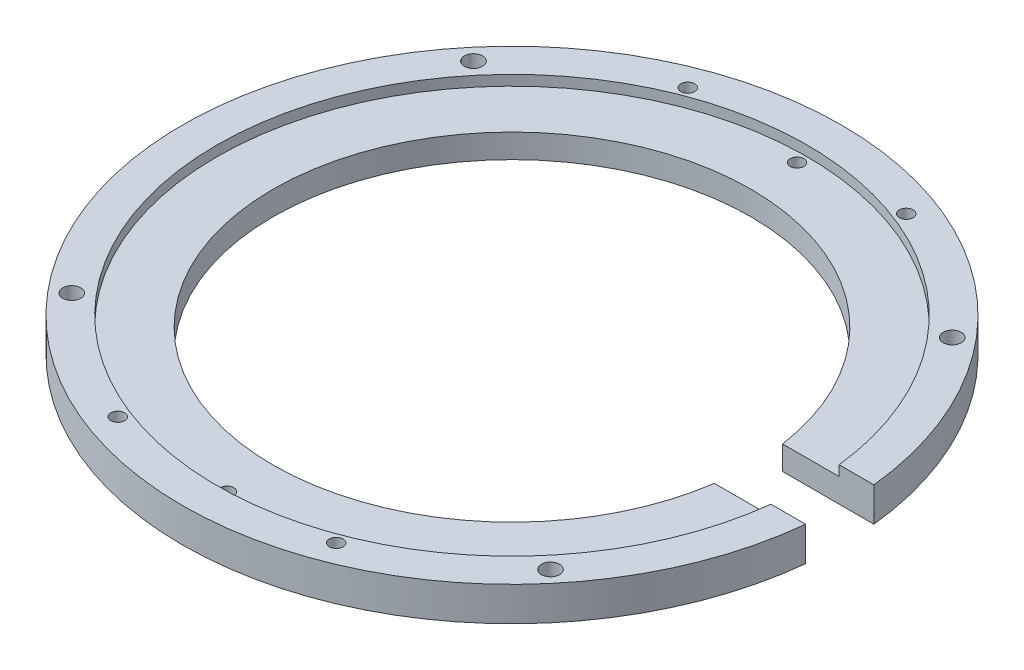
ISO-10303-21;
HEADER;
FILE_DESCRIPTION(('STEP AP214'),'2;1');
FILE_NAME('part.step','',(''),(''),'','','');
FILE_SCHEMA(('AUTOMOTIVE_DESIGN { 1 0 10303 214 1 1 1 1 }'));
ENDSEC;
DATA;
#1=APPLICATION_CONTEXT('core data for automotive mechanical design processes');
#2=APPLICATION_PROTOCOL_DEFINITION('international standard','automotive_design',2000,#1);
#3=PRODUCT_CONTEXT('',#1,'mechanical');
#4=PRODUCT('Part','Part','',(#3));
#5=PRODUCT_RELATED_PRODUCT_CATEGORY('part','',(#4));
#6=PRODUCT_DEFINITION_FORMATION('','',#4);
#7=PRODUCT_DEFINITION_CONTEXT('part definition',#1,'design');
#8=PRODUCT_DEFINITION('design','',#6,#7);
#9=PRODUCT_DEFINITION_SHAPE('','',#8);
#10=(LENGTH_UNIT() NAMED_UNIT(*) SI_UNIT(.MILLI.,.METRE.));
#11=(NAMED_UNIT(*) PLANE_ANGLE_UNIT() SI_UNIT($,.RADIAN.));
#12=(NAMED_UNIT(*) SI_UNIT($,.STERADIAN.) SOLID_ANGLE_UNIT());
#13=UNCERTAINTY_MEASURE_WITH_UNIT(LENGTH_MEASURE(1.E-05),#10,'distance_accuracy_value','');
#14=(GEOMETRIC_REPRESENTATION_CONTEXT(3) GLOBAL_UNCERTAINTY_ASSIGNED_CONTEXT((#13)) GLOBAL_UNIT_ASSIGNED_CONTEXT((#10,
#11,#12)) REPRESENTATION_CONTEXT('',''));
#15=CARTESIAN_POINT('',(0.,0.,0.));
#16=DIRECTION('',(0.,0.,1.));
#17=DIRECTION('',(1.,0.,0.));
#18=AXIS2_PLACEMENT_3D('',#15,#16,#17);
#19=CARTESIAN_POINT('',(0.,0.,0.));
#20=DIRECTION('',(0.,-1.,0.));
#21=DIRECTION('',(0.,0.,-1.));
#22=AXIS2_PLACEMENT_3D('',#19,#20,#21);
#23=CYLINDRICAL_SURFACE('',#22,122.618499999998);
#24=CARTESIAN_POINT('',(0.,12.7,0.));
#25=DIRECTION('',(0.,-1.,0.));
#26=DIRECTION('',(0.,0.,-1.));
#27=AXIS2_PLACEMENT_3D('',#24,#25,#26);
#28=CIRCLE('',#27,122.618499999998);
#29=CARTESIAN_POINT('',(121.959036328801,12.7,12.6999999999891));
#30=VERTEX_POINT('',#29);
#31=CARTESIAN_POINT('',(121.959036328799,12.7,-12.7000000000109));
#32=VERTEX_POINT('',#31);
#33=EDGE_CURVE('E152',#30,#32,#28,.T.);
#34=ORIENTED_EDGE('',*,*,#33,.T.);
#35=DIRECTION('',(0.,-1.,0.));
#36=VECTOR('',#35,1.);
#37=CARTESIAN_POINT('',(121.959036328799,0.,-12.7000000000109));
#38=LINE('',#37,#36);
#39=CARTESIAN_POINT('',(121.959036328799,0.,-12.7000000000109));
#40=VERTEX_POINT('',#39);
#41=EDGE_CURVE('E75',#32,#40,#38,.T.);
#42=ORIENTED_EDGE('',*,*,#41,.T.);
#43=CARTESIAN_POINT('',(0.,0.,0.));
#44=DIRECTION('',(0.,-1.,0.));
#45=DIRECTION('',(0.,0.,-1.));
#46=AXIS2_PLACEMENT_3D('',#43,#44,#45);
#47=CIRCLE('',#46,122.618499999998);
#48=CARTESIAN_POINT('',(121.959036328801,0.,12.6999999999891));
#49=VERTEX_POINT('',#48);
#50=EDGE_CURVE('E126',#49,#40,#47,.T.);
#51=ORIENTED_EDGE('',*,*,#50,.F.);
#52=DIRECTION('',(0.,-1.,0.));
#53=VECTOR('',#52,1.);
#54=CARTESIAN_POINT('',(121.959036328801,0.,12.6999999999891));
#55=LINE('',#54,#53);
#56=EDGE_CURVE('E108',#49,#30,#55,.F.);
#57=ORIENTED_EDGE('',*,*,#56,.T.);
#58=EDGE_LOOP('',(#34,#42,#51,#57));
#59=FACE_BOUND('',#58,.T.);
#60=ADVANCED_FACE('F46',(#59),#23,.T.);
#61=CARTESIAN_POINT('',(-88.9,0.,0.));
#62=DIRECTION('',(0.,1.,0.));
#63=DIRECTION('',(0.,0.,1.));
#64=AXIS2_PLACEMENT_3D('',#61,#62,#63);
#65=PLANE('',#64);
#66=CARTESIAN_POINT('',(-89.0668383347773,0.,-74.7359511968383));
#67=DIRECTION('',(0.,-1.,0.));
#68=DIRECTION('',(0.,0.,-1.));
#69=AXIS2_PLACEMENT_3D('',#66,#67,#68);
#70=CIRCLE('',#69,3.37350099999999);
#71=CARTESIAN_POINT('',(-89.0668383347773,0.,-78.1094521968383));
#72=VERTEX_POINT('',#71);
#73=EDGE_CURVE('E225',#72,#72,#70,.T.);
#74=ORIENTED_EDGE('',*,*,#73,.F.);
#75=EDGE_LOOP('',(#74));
#76=FACE_BOUND('',#75,.T.);
#77=CARTESIAN_POINT('',(-89.0668383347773,0.,74.7359511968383));
#78=DIRECTION('',(0.,-1.,0.));
#79=DIRECTION('',(0.,0.,-1.));
#80=AXIS2_PLACEMENT_3D('',#77,#78,#79);
#81=CIRCLE('',#80,3.37350099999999);
#82=CARTESIAN_POINT('',(-89.0668383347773,0.,71.3624501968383));
#83=VERTEX_POINT('',#82);
#84=EDGE_CURVE('E217',#83,#83,#81,.T.);
#85=ORIENTED_EDGE('',*,*,#84,.F.);
#86=EDGE_LOOP('',(#85));
#87=FACE_BOUND('',#86,.T.);
#88=CARTESIAN_POINT('',(89.0668383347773,0.,74.7359511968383));
#89=DIRECTION('',(0.,-1.,0.));
#90=DIRECTION('',(0.,0.,-1.));
#91=AXIS2_PLACEMENT_3D('',#88,#89,#90);
#92=CIRCLE('',#91,3.37350099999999);
#93=CARTESIAN_POINT('',(89.0668383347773,0.,71.3624501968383));
#94=VERTEX_POINT('',#93);
#95=EDGE_CURVE('E209',#94,#94,#92,.T.);
#96=ORIENTED_EDGE('',*,*,#95,.F.);
#97=EDGE_LOOP('',(#96));
#98=FACE_BOUND('',#97,.T.);
#99=CARTESIAN_POINT('',(89.0668383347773,0.,-74.7359511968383));
#100=DIRECTION('',(0.,-1.,0.));
#101=DIRECTION('',(0.,0.,-1.));
#102=AXIS2_PLACEMENT_3D('',#99,#100,#101);
#103=CIRCLE('',#102,3.37350099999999);
#104=CARTESIAN_POINT('',(89.0668383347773,0.,-78.1094521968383));
#105=VERTEX_POINT('',#104);
#106=EDGE_CURVE('E201',#105,#105,#103,.T.);
#107=ORIENTED_EDGE('',*,*,#106,.F.);
#108=EDGE_LOOP('',(#107));
#109=FACE_BOUND('',#108,.T.);
#110=CARTESIAN_POINT('',(-40.64,0.,106.045));
#111=DIRECTION('',(0.,-1.,0.));
#112=DIRECTION('',(0.,0.,-1.));
#113=AXIS2_PLACEMENT_3D('',#110,#111,#112);
#114=CIRCLE('',#113,2.5527);
#115=CARTESIAN_POINT('',(-40.64,0.,103.4923));
#116=VERTEX_POINT('',#115);
#117=EDGE_CURVE('E194',#116,#116,#114,.T.);
#118=ORIENTED_EDGE('',*,*,#117,.F.);
#119=EDGE_LOOP('',(#118));
#120=FACE_BOUND('',#119,.T.);
#121=CARTESIAN_POINT('',(40.64,0.,106.045));
#122=DIRECTION('',(0.,-1.,0.));
#123=DIRECTION('',(0.,0.,-1.));
#124=AXIS2_PLACEMENT_3D('',#121,#122,#123);
#125=CIRCLE('',#124,2.5527);
#126=CARTESIAN_POINT('',(40.64,0.,103.4923));
#127=VERTEX_POINT('',#126);
#128=EDGE_CURVE('E186',#127,#127,#125,.T.);
#129=ORIENTED_EDGE('',*,*,#128,.F.);
#130=EDGE_LOOP('',(#129));
#131=FACE_BOUND('',#130,.T.);
#132=CARTESIAN_POINT('',(-40.64,0.,-106.045));
#133=DIRECTION('',(0.,-1.,0.));
#134=DIRECTION('',(0.,0.,-1.));
#135=AXIS2_PLACEMENT_3D('',#132,#133,#134);
#136=CIRCLE('',#135,2.5527);
#137=CARTESIAN_POINT('',(-40.64,0.,-108.5977));
#138=VERTEX_POINT('',#137);
#139=EDGE_CURVE('E178',#138,#138,#136,.T.);
#140=ORIENTED_EDGE('',*,*,#139,.F.);
#141=EDGE_LOOP('',(#140));
#142=FACE_BOUND('',#141,.T.);
#143=CARTESIAN_POINT('',(40.64,0.,-106.045));
#144=DIRECTION('',(0.,-1.,0.));
#145=DIRECTION('',(0.,0.,-1.));
#146=AXIS2_PLACEMENT_3D('',#143,#144,#145);
#147=CIRCLE('',#146,2.5527);
#148=CARTESIAN_POINT('',(40.64,0.,-108.5977));
#149=VERTEX_POINT('',#148);
#150=EDGE_CURVE('E172',#149,#149,#147,.T.);
#151=ORIENTED_EDGE('',*,*,#150,.F.);
#152=EDGE_LOOP('',(#151));
#153=FACE_BOUND('',#152,.T.);
#154=CARTESIAN_POINT('',(0.,0.,-106.045));
#155=DIRECTION('',(0.,-1.,0.));
#156=DIRECTION('',(0.,0.,-1.));
#157=AXIS2_PLACEMENT_3D('',#154,#155,#156);
#158=CIRCLE('',#157,2.5527);
#159=CARTESIAN_POINT('',(0.,0.,-108.5977));
#160=VERTEX_POINT('',#159);
#161=EDGE_CURVE('E166',#160,#160,#158,.T.);
#162=ORIENTED_EDGE('',*,*,#161,.F.);
#163=EDGE_LOOP('',(#162));
#164=FACE_BOUND('',#163,.T.);
#165=CARTESIAN_POINT('',(0.,0.,106.045));
#166=DIRECTION('',(0.,-1.,0.));
#167=DIRECTION('',(0.,0.,-1.));
#168=AXIS2_PLACEMENT_3D('',#165,#166,#167);
#169=CIRCLE('',#168,2.5527);
#170=CARTESIAN_POINT('',(0.,0.,103.4923));
#171=VERTEX_POINT('',#170);
#172=EDGE_CURVE('E159',#171,#171,#169,.T.);
#173=ORIENTED_EDGE('',*,*,#172,.F.);
#174=EDGE_LOOP('',(#173));
#175=FACE_BOUND('',#174,.T.);
#176=ORIENTED_EDGE('',*,*,#50,.T.);
#177=DIRECTION('',(1.,0.,0.));
#178=VECTOR('',#177,1.);
#179=CARTESIAN_POINT('',(61.1298426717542,0.,-12.7000000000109));
#180=LINE('',#179,#178);
#181=CARTESIAN_POINT('',(87.9881810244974,0.,-12.7000000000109));
#182=VERTEX_POINT('',#181);
#183=EDGE_CURVE('E130',#182,#40,#180,.T.);
#184=ORIENTED_EDGE('',*,*,#183,.F.);
#185=CARTESIAN_POINT('',(0.,0.,0.));
#186=DIRECTION('',(0.,-1.,0.));
#187=DIRECTION('',(0.,0.,-1.));
#188=AXIS2_PLACEMENT_3D('',#185,#186,#187);
#189=CIRCLE('',#188,88.9);
#190=CARTESIAN_POINT('',(87.9881810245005,0.,12.6999999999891));
#191=VERTEX_POINT('',#190);
#192=EDGE_CURVE('E128',#191,#182,#189,.T.);
#193=ORIENTED_EDGE('',*,*,#192,.F.);
#194=DIRECTION('',(-1.,0.,0.));
#195=VECTOR('',#194,1.);
#196=CARTESIAN_POINT('',(61.1298426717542,0.,12.6999999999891));
#197=LINE('',#196,#195);
#198=EDGE_CURVE('E111',#49,#191,#197,.T.);
#199=ORIENTED_EDGE('',*,*,#198,.F.);
#200=EDGE_LOOP('',(#176,#184,#193,#199));
#201=FACE_BOUND('',#200,.T.);
#202=ADVANCED_FACE('F124',(#76,#87,#98,#109,#120,#131,#142,#153,#164,#175,#201),#65,.F.);
#203=CARTESIAN_POINT('',(0.,0.,0.));
#204=DIRECTION('',(0.,-1.,0.));
#205=DIRECTION('',(0.,0.,-1.));
#206=AXIS2_PLACEMENT_3D('',#203,#204,#205);
#207=CYLINDRICAL_SURFACE('',#206,88.9);
#208=ORIENTED_EDGE('',*,*,#192,.T.);
#209=DIRECTION('',(0.,-1.,0.));
#210=VECTOR('',#209,1.);
#211=CARTESIAN_POINT('',(87.9881810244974,0.,-12.7000000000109));
#212=LINE('',#211,#210);
#213=CARTESIAN_POINT('',(87.9881810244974,8.89000000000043,-12.7000000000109));
#214=VERTEX_POINT('',#213);
#215=EDGE_CURVE('E230',#182,#214,#212,.F.);
#216=ORIENTED_EDGE('',*,*,#215,.T.);
#217=CARTESIAN_POINT('',(0.,8.89000000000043,0.));
#218=DIRECTION('',(0.,-1.,0.));
#219=DIRECTION('',(0.,0.,-1.));
#220=AXIS2_PLACEMENT_3D('',#217,#218,#219);
#221=CIRCLE('',#220,88.9);
#222=CARTESIAN_POINT('',(87.9881810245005,8.89000000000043,12.6999999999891));
#223=VERTEX_POINT('',#222);
#224=EDGE_CURVE('E138',#223,#214,#221,.T.);
#225=ORIENTED_EDGE('',*,*,#224,.F.);
#226=DIRECTION('',(0.,-1.,0.));
#227=VECTOR('',#226,1.);
#228=CARTESIAN_POINT('',(87.9881810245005,0.,12.6999999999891));
#229=LINE('',#228,#227);
#230=EDGE_CURVE('E119',#223,#191,#229,.T.);
#231=ORIENTED_EDGE('',*,*,#230,.T.);
#232=EDGE_LOOP('',(#208,#216,#225,#231));
#233=FACE_BOUND('',#232,.T.);
#234=ADVANCED_FACE('F251',(#233),#207,.F.);
#235=CARTESIAN_POINT('',(-109.791499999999,8.89000000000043,0.));
#236=DIRECTION('',(0.,-1.,0.));
#237=DIRECTION('',(0.,0.,-1.));
#238=AXIS2_PLACEMENT_3D('',#235,#236,#237);
#239=PLANE('',#238);
#240=CARTESIAN_POINT('',(0.,8.89000000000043,-106.045));
#241=DIRECTION('',(0.,-1.,0.));
#242=DIRECTION('',(0.,0.,-1.));
#243=AXIS2_PLACEMENT_3D('',#240,#241,#242);
#244=CIRCLE('',#243,2.5527);
#245=CARTESIAN_POINT('',(0.,8.89000000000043,-108.5977));
#246=VERTEX_POINT('',#245);
#247=EDGE_CURVE('E163',#246,#246,#244,.T.);
#248=ORIENTED_EDGE('',*,*,#247,.T.);
#249=EDGE_LOOP('',(#248));
#250=FACE_BOUND('',#249,.T.);
#251=CARTESIAN_POINT('',(0.,8.89000000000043,106.045));
#252=DIRECTION('',(0.,-1.,0.));
#253=DIRECTION('',(0.,0.,-1.));
#254=AXIS2_PLACEMENT_3D('',#251,#252,#253);
#255=CIRCLE('',#254,2.5527);
#256=CARTESIAN_POINT('',(0.,8.89000000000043,103.4923));
#257=VERTEX_POINT('',#256);
#258=EDGE_CURVE('E155',#257,#257,#255,.T.);
#259=ORIENTED_EDGE('',*,*,#258,.T.);
#260=EDGE_LOOP('',(#259));
#261=FACE_BOUND('',#260,.T.);
#262=ORIENTED_EDGE('',*,*,#224,.T.);
#263=DIRECTION('',(1.,0.,0.));
#264=VECTOR('',#263,1.);
#265=CARTESIAN_POINT('',(-109.791499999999,8.89000000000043,-12.7000000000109));
#266=LINE('',#265,#264);
#267=CARTESIAN_POINT('',(109.054497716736,8.89000000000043,-12.7000000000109));
#268=VERTEX_POINT('',#267);
#269=EDGE_CURVE('E234',#214,#268,#266,.T.);
#270=ORIENTED_EDGE('',*,*,#269,.T.);
#271=CARTESIAN_POINT('',(0.,8.89000000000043,0.));
#272=DIRECTION('',(0.,-1.,0.));
#273=DIRECTION('',(0.,0.,-1.));
#274=AXIS2_PLACEMENT_3D('',#271,#272,#273);
#275=CIRCLE('',#274,109.791499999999);
#276=CARTESIAN_POINT('',(109.054497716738,8.89000000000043,12.6999999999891));
#277=VERTEX_POINT('',#276);
#278=EDGE_CURVE('E144',#277,#268,#275,.T.);
#279=ORIENTED_EDGE('',*,*,#278,.F.);
#280=DIRECTION('',(-1.,0.,0.));
#281=VECTOR('',#280,1.);
#282=CARTESIAN_POINT('',(-109.791499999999,8.89000000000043,12.6999999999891));
#283=LINE('',#282,#281);
#284=EDGE_CURVE('E242',#277,#223,#283,.T.);
#285=ORIENTED_EDGE('',*,*,#284,.T.);
#286=EDGE_LOOP('',(#262,#270,#279,#285));
#287=FACE_BOUND('',#286,.T.);
#288=ADVANCED_FACE('F255',(#250,#261,#287),#239,.F.);
#289=CARTESIAN_POINT('',(0.,0.,0.));
#290=DIRECTION('',(0.,-1.,0.));
#291=DIRECTION('',(0.,0.,-1.));
#292=AXIS2_PLACEMENT_3D('',#289,#290,#291);
#293=CYLINDRICAL_SURFACE('',#292,109.791499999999);
#294=ORIENTED_EDGE('',*,*,#278,.T.);
#295=DIRECTION('',(0.,-1.,0.));
#296=VECTOR('',#295,1.);
#297=CARTESIAN_POINT('',(109.054497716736,0.,-12.7000000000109));
#298=LINE('',#297,#296);
#299=CARTESIAN_POINT('',(109.054497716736,12.7,-12.7000000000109));
#300=VERTEX_POINT('',#299);
#301=EDGE_CURVE('E118',#268,#300,#298,.F.);
#302=ORIENTED_EDGE('',*,*,#301,.T.);
#303=CARTESIAN_POINT('',(0.,12.7,0.));
#304=DIRECTION('',(0.,-1.,0.));
#305=DIRECTION('',(0.,0.,-1.));
#306=AXIS2_PLACEMENT_3D('',#303,#304,#305);
#307=CIRCLE('',#306,109.791499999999);
#308=CARTESIAN_POINT('',(109.054497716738,12.7,12.6999999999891));
#309=VERTEX_POINT('',#308);
#310=EDGE_CURVE('E148',#309,#300,#307,.T.);
#311=ORIENTED_EDGE('',*,*,#310,.F.);
#312=DIRECTION('',(0.,-1.,0.));
#313=VECTOR('',#312,1.);
#314=CARTESIAN_POINT('',(109.054497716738,0.,12.6999999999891));
#315=LINE('',#314,#313);
#316=EDGE_CURVE('E64',#309,#277,#315,.T.);
#317=ORIENTED_EDGE('',*,*,#316,.T.);
#318=EDGE_LOOP('',(#294,#302,#311,#317));
#319=FACE_BOUND('',#318,.T.);
#320=ADVANCED_FACE('F257',(#319),#293,.F.);
#321=CARTESIAN_POINT('',(-109.791499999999,12.7,0.));
#322=DIRECTION('',(0.,-1.,0.));
#323=DIRECTION('',(0.,0.,-1.));
#324=AXIS2_PLACEMENT_3D('',#321,#322,#323);
#325=PLANE('',#324);
#326=CARTESIAN_POINT('',(-89.0668383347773,12.7,-74.7359511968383));
#327=DIRECTION('',(0.,-1.,0.));
#328=DIRECTION('',(0.,0.,-1.));
#329=AXIS2_PLACEMENT_3D('',#326,#327,#328);
#330=CIRCLE('',#329,3.373501);
#331=CARTESIAN_POINT('',(-89.0668383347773,12.7,-78.1094521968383));
#332=VERTEX_POINT('',#331);
#333=EDGE_CURVE('E221',#332,#332,#330,.T.);
#334=ORIENTED_EDGE('',*,*,#333,.T.);
#335=EDGE_LOOP('',(#334));
#336=FACE_BOUND('',#335,.T.);
#337=CARTESIAN_POINT('',(-89.0668383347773,12.7,74.7359511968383));
#338=DIRECTION('',(0.,-1.,0.));
#339=DIRECTION('',(0.,0.,-1.));
#340=AXIS2_PLACEMENT_3D('',#337,#338,#339);
#341=CIRCLE('',#340,3.373501);
#342=CARTESIAN_POINT('',(-89.0668383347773,12.7,71.3624501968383));
#343=VERTEX_POINT('',#342);
#344=EDGE_CURVE('E213',#343,#343,#341,.T.);
#345=ORIENTED_EDGE('',*,*,#344,.T.);
#346=EDGE_LOOP('',(#345));
#347=FACE_BOUND('',#346,.T.);
#348=CARTESIAN_POINT('',(89.0668383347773,12.7,74.7359511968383));
#349=DIRECTION('',(0.,-1.,0.));
#350=DIRECTION('',(0.,0.,-1.));
#351=AXIS2_PLACEMENT_3D('',#348,#349,#350);
#352=CIRCLE('',#351,3.373501);
#353=CARTESIAN_POINT('',(89.0668383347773,12.7,71.3624501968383));
#354=VERTEX_POINT('',#353);
#355=EDGE_CURVE('E205',#354,#354,#352,.T.);
#356=ORIENTED_EDGE('',*,*,#355,.T.);
#357=EDGE_LOOP('',(#356));
#358=FACE_BOUND('',#357,.T.);
#359=CARTESIAN_POINT('',(89.0668383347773,12.7,-74.7359511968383));
#360=DIRECTION('',(0.,-1.,0.));
#361=DIRECTION('',(0.,0.,-1.));
#362=AXIS2_PLACEMENT_3D('',#359,#360,#361);
#363=CIRCLE('',#362,3.373501);
#364=CARTESIAN_POINT('',(89.0668383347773,12.7,-78.1094521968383));
#365=VERTEX_POINT('',#364);
#366=EDGE_CURVE('E198',#365,#365,#363,.T.);
#367=ORIENTED_EDGE('',*,*,#366,.T.);
#368=EDGE_LOOP('',(#367));
#369=FACE_BOUND('',#368,.T.);
#370=CARTESIAN_POINT('',(-40.64,12.7,106.045));
#371=DIRECTION('',(0.,-1.,0.));
#372=DIRECTION('',(0.,0.,-1.));
#373=AXIS2_PLACEMENT_3D('',#370,#371,#372);
#374=CIRCLE('',#373,2.5527);
#375=CARTESIAN_POINT('',(-40.64,12.7,103.4923));
#376=VERTEX_POINT('',#375);
#377=EDGE_CURVE('E190',#376,#376,#374,.T.);
#378=ORIENTED_EDGE('',*,*,#377,.T.);
#379=EDGE_LOOP('',(#378));
#380=FACE_BOUND('',#379,.T.);
#381=CARTESIAN_POINT('',(40.64,12.7,106.045));
#382=DIRECTION('',(0.,-1.,0.));
#383=DIRECTION('',(0.,0.,-1.));
#384=AXIS2_PLACEMENT_3D('',#381,#382,#383);
#385=CIRCLE('',#384,2.5527);
#386=CARTESIAN_POINT('',(40.64,12.7,103.4923));
#387=VERTEX_POINT('',#386);
#388=EDGE_CURVE('E182',#387,#387,#385,.T.);
#389=ORIENTED_EDGE('',*,*,#388,.T.);
#390=EDGE_LOOP('',(#389));
#391=FACE_BOUND('',#390,.T.);
#392=CARTESIAN_POINT('',(-40.64,12.7,-106.045));
#393=DIRECTION('',(0.,-1.,0.));
#394=DIRECTION('',(0.,0.,-1.));
#395=AXIS2_PLACEMENT_3D('',#392,#393,#394);
#396=CIRCLE('',#395,2.5527);
#397=CARTESIAN_POINT('',(-40.64,12.7,-108.5977));
#398=VERTEX_POINT('',#397);
#399=EDGE_CURVE('E175',#398,#398,#396,.T.);
#400=ORIENTED_EDGE('',*,*,#399,.T.);
#401=EDGE_LOOP('',(#400));
#402=FACE_BOUND('',#401,.T.);
#403=CARTESIAN_POINT('',(40.64,12.7,-106.045));
#404=DIRECTION('',(0.,-1.,0.));
#405=DIRECTION('',(0.,0.,-1.));
#406=AXIS2_PLACEMENT_3D('',#403,#404,#405);
#407=CIRCLE('',#406,2.5527);
#408=CARTESIAN_POINT('',(40.64,12.7,-108.5977));
#409=VERTEX_POINT('',#408);
#410=EDGE_CURVE('E169',#409,#409,#407,.T.);
#411=ORIENTED_EDGE('',*,*,#410,.T.);
#412=EDGE_LOOP('',(#411));
#413=FACE_BOUND('',#412,.T.);
#414=ORIENTED_EDGE('',*,*,#310,.T.);
#415=DIRECTION('',(1.,0.,0.));
#416=VECTOR('',#415,1.);
#417=CARTESIAN_POINT('',(-109.791499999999,12.7,-12.7000000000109));
#418=LINE('',#417,#416);
#419=EDGE_CURVE('E11',#300,#32,#418,.T.);
#420=ORIENTED_EDGE('',*,*,#419,.T.);
#421=ORIENTED_EDGE('',*,*,#33,.F.);
#422=DIRECTION('',(-1.,0.,0.));
#423=VECTOR('',#422,1.);
#424=CARTESIAN_POINT('',(-109.791499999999,12.7,12.6999999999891));
#425=LINE('',#424,#423);
#426=EDGE_CURVE('E54',#30,#309,#425,.T.);
#427=ORIENTED_EDGE('',*,*,#426,.T.);
#428=EDGE_LOOP('',(#414,#420,#421,#427));
#429=FACE_BOUND('',#428,.T.);
#430=ADVANCED_FACE('F260',(#336,#347,#358,#369,#380,#391,#402,#413,#429),#325,.F.);
#431=CARTESIAN_POINT('',(0.,0.,106.045));
#432=DIRECTION('',(0.,-1.,0.));
#433=DIRECTION('',(0.,0.,-1.));
#434=AXIS2_PLACEMENT_3D('',#431,#432,#433);
#435=CYLINDRICAL_SURFACE('',#434,2.5527);
#436=ORIENTED_EDGE('',*,*,#172,.T.);
#437=EDGE_LOOP('',(#436));
#438=FACE_BOUND('',#437,.T.);
#439=ORIENTED_EDGE('',*,*,#258,.F.);
#440=EDGE_LOOP('',(#439));
#441=FACE_BOUND('',#440,.T.);
#442=ADVANCED_FACE('F262',(#438,#441),#435,.F.);
#443=CARTESIAN_POINT('',(0.,0.,-106.045));
#444=DIRECTION('',(0.,-1.,0.));
#445=DIRECTION('',(0.,0.,-1.));
#446=AXIS2_PLACEMENT_3D('',#443,#444,#445);
#447=CYLINDRICAL_SURFACE('',#446,2.5527);
#448=ORIENTED_EDGE('',*,*,#161,.T.);
#449=EDGE_LOOP('',(#448));
#450=FACE_BOUND('',#449,.T.);
#451=ORIENTED_EDGE('',*,*,#247,.F.);
#452=EDGE_LOOP('',(#451));
#453=FACE_BOUND('',#452,.T.);
#454=ADVANCED_FACE('F269',(#450,#453),#447,.F.);
#455=CARTESIAN_POINT('',(40.64,0.,-106.045));
#456=DIRECTION('',(0.,-1.,0.));
#457=DIRECTION('',(0.,0.,-1.));
#458=AXIS2_PLACEMENT_3D('',#455,#456,#457);
#459=CYLINDRICAL_SURFACE('',#458,2.5527);
#460=ORIENTED_EDGE('',*,*,#410,.F.);
#461=EDGE_LOOP('',(#460));
#462=FACE_BOUND('',#461,.T.);
#463=ORIENTED_EDGE('',*,*,#150,.T.);
#464=EDGE_LOOP('',(#463));
#465=FACE_BOUND('',#464,.T.);
#466=ADVANCED_FACE('F296',(#462,#465),#459,.F.);
#467=CARTESIAN_POINT('',(-40.64,0.,-106.045));
#468=DIRECTION('',(0.,-1.,0.));
#469=DIRECTION('',(0.,0.,-1.));
#470=AXIS2_PLACEMENT_3D('',#467,#468,#469);
#471=CYLINDRICAL_SURFACE('',#470,2.5527);
#472=ORIENTED_EDGE('',*,*,#399,.F.);
#473=EDGE_LOOP('',(#472));
#474=FACE_BOUND('',#473,.T.);
#475=ORIENTED_EDGE('',*,*,#139,.T.);
#476=EDGE_LOOP('',(#475));
#477=FACE_BOUND('',#476,.T.);
#478=ADVANCED_FACE('F302',(#474,#477),#471,.F.);
#479=CARTESIAN_POINT('',(40.64,0.,106.045));
#480=DIRECTION('',(0.,-1.,0.));
#481=DIRECTION('',(0.,0.,-1.));
#482=AXIS2_PLACEMENT_3D('',#479,#480,#481);
#483=CYLINDRICAL_SURFACE('',#482,2.5527);
#484=ORIENTED_EDGE('',*,*,#388,.F.);
#485=EDGE_LOOP('',(#484));
#486=FACE_BOUND('',#485,.T.);
#487=ORIENTED_EDGE('',*,*,#128,.T.);
#488=EDGE_LOOP('',(#487));
#489=FACE_BOUND('',#488,.T.);
#490=ADVANCED_FACE('F308',(#486,#489),#483,.F.);
#491=CARTESIAN_POINT('',(-40.64,0.,106.045));
#492=DIRECTION('',(0.,-1.,0.));
#493=DIRECTION('',(0.,0.,-1.));
#494=AXIS2_PLACEMENT_3D('',#491,#492,#493);
#495=CYLINDRICAL_SURFACE('',#494,2.5527);
#496=ORIENTED_EDGE('',*,*,#377,.F.);
#497=EDGE_LOOP('',(#496));
#498=FACE_BOUND('',#497,.T.);
#499=ORIENTED_EDGE('',*,*,#117,.T.);
#500=EDGE_LOOP('',(#499));
#501=FACE_BOUND('',#500,.T.);
#502=ADVANCED_FACE('F312',(#498,#501),#495,.F.);
#503=CARTESIAN_POINT('',(89.0668383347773,0.,-74.7359511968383));
#504=DIRECTION('',(0.,-1.,0.));
#505=DIRECTION('',(0.,0.,-1.));
#506=AXIS2_PLACEMENT_3D('',#503,#504,#505);
#507=CYLINDRICAL_SURFACE('',#506,3.37350099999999);
#508=ORIENTED_EDGE('',*,*,#366,.F.);
#509=EDGE_LOOP('',(#508));
#510=FACE_BOUND('',#509,.T.);
#511=ORIENTED_EDGE('',*,*,#106,.T.);
#512=EDGE_LOOP('',(#511));
#513=FACE_BOUND('',#512,.T.);
#514=ADVANCED_FACE('F316',(#510,#513),#507,.F.);
#515=CARTESIAN_POINT('',(89.0668383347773,0.,74.7359511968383));
#516=DIRECTION('',(0.,-1.,0.));
#517=DIRECTION('',(0.,0.,-1.));
#518=AXIS2_PLACEMENT_3D('',#515,#516,#517);
#519=CYLINDRICAL_SURFACE('',#518,3.37350099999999);
#520=ORIENTED_EDGE('',*,*,#355,.F.);
#521=EDGE_LOOP('',(#520));
#522=FACE_BOUND('',#521,.T.);
#523=ORIENTED_EDGE('',*,*,#95,.T.);
#524=EDGE_LOOP('',(#523));
#525=FACE_BOUND('',#524,.T.);
#526=ADVANCED_FACE('F320',(#522,#525),#519,.F.);
#527=CARTESIAN_POINT('',(-89.0668383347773,0.,74.7359511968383));
#528=DIRECTION('',(0.,-1.,0.));
#529=DIRECTION('',(0.,0.,-1.));
#530=AXIS2_PLACEMENT_3D('',#527,#528,#529);
#531=CYLINDRICAL_SURFACE('',#530,3.37350099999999);
#532=ORIENTED_EDGE('',*,*,#344,.F.);
#533=EDGE_LOOP('',(#532));
#534=FACE_BOUND('',#533,.T.);
#535=ORIENTED_EDGE('',*,*,#84,.T.);
#536=EDGE_LOOP('',(#535));
#537=FACE_BOUND('',#536,.T.);
#538=ADVANCED_FACE('F324',(#534,#537),#531,.F.);
#539=CARTESIAN_POINT('',(-89.0668383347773,0.,-74.7359511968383));
#540=DIRECTION('',(0.,-1.,0.));
#541=DIRECTION('',(0.,0.,-1.));
#542=AXIS2_PLACEMENT_3D('',#539,#540,#541);
#543=CYLINDRICAL_SURFACE('',#542,3.37350099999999);
#544=ORIENTED_EDGE('',*,*,#333,.F.);
#545=EDGE_LOOP('',(#544));
#546=FACE_BOUND('',#545,.T.);
#547=ORIENTED_EDGE('',*,*,#73,.T.);
#548=EDGE_LOOP('',(#547));
#549=FACE_BOUND('',#548,.T.);
#550=ADVANCED_FACE('F328',(#546,#549),#543,.F.);
#551=CARTESIAN_POINT('',(61.1298426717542,12.7,12.6999999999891));
#552=DIRECTION('',(0.,0.,1.));
#553=DIRECTION('',(1.,0.,0.));
#554=AXIS2_PLACEMENT_3D('',#551,#552,#553);
#555=PLANE('',#554);
#556=ORIENTED_EDGE('',*,*,#198,.T.);
#557=ORIENTED_EDGE('',*,*,#230,.F.);
#558=ORIENTED_EDGE('',*,*,#284,.F.);
#559=ORIENTED_EDGE('',*,*,#316,.F.);
#560=ORIENTED_EDGE('',*,*,#426,.F.);
#561=ORIENTED_EDGE('',*,*,#56,.F.);
#562=EDGE_LOOP('',(#556,#557,#558,#559,#560,#561));
#563=FACE_BOUND('',#562,.T.);
#564=ADVANCED_FACE('F110',(#563),#555,.F.);
#565=CARTESIAN_POINT('',(61.1298426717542,12.7,-12.7000000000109));
#566=DIRECTION('',(0.,0.,-1.));
#567=DIRECTION('',(-1.,0.,0.));
#568=AXIS2_PLACEMENT_3D('',#565,#566,#567);
#569=PLANE('',#568);
#570=ORIENTED_EDGE('',*,*,#419,.F.);
#571=ORIENTED_EDGE('',*,*,#301,.F.);
#572=ORIENTED_EDGE('',*,*,#269,.F.);
#573=ORIENTED_EDGE('',*,*,#215,.F.);
#574=ORIENTED_EDGE('',*,*,#183,.T.);
#575=ORIENTED_EDGE('',*,*,#41,.F.);
#576=EDGE_LOOP('',(#570,#571,#572,#573,#574,#575));
#577=FACE_BOUND('',#576,.T.);
#578=ADVANCED_FACE('F249',(#577),#569,.F.);
#579=CLOSED_SHELL('',(#60,#202,#234,#288,#320,#430,#442,#454,#466,#478,#490,#502,#514,#526,#538,
#550,#564,#578));
#580=MANIFOLD_SOLID_BREP('B2',#579);
#581=ADVANCED_BREP_SHAPE_REPRESENTATION('',(#18,#580),#14);
#582=SHAPE_DEFINITION_REPRESENTATION(#9,#581);
ENDSEC;
END-ISO-10303-21;
